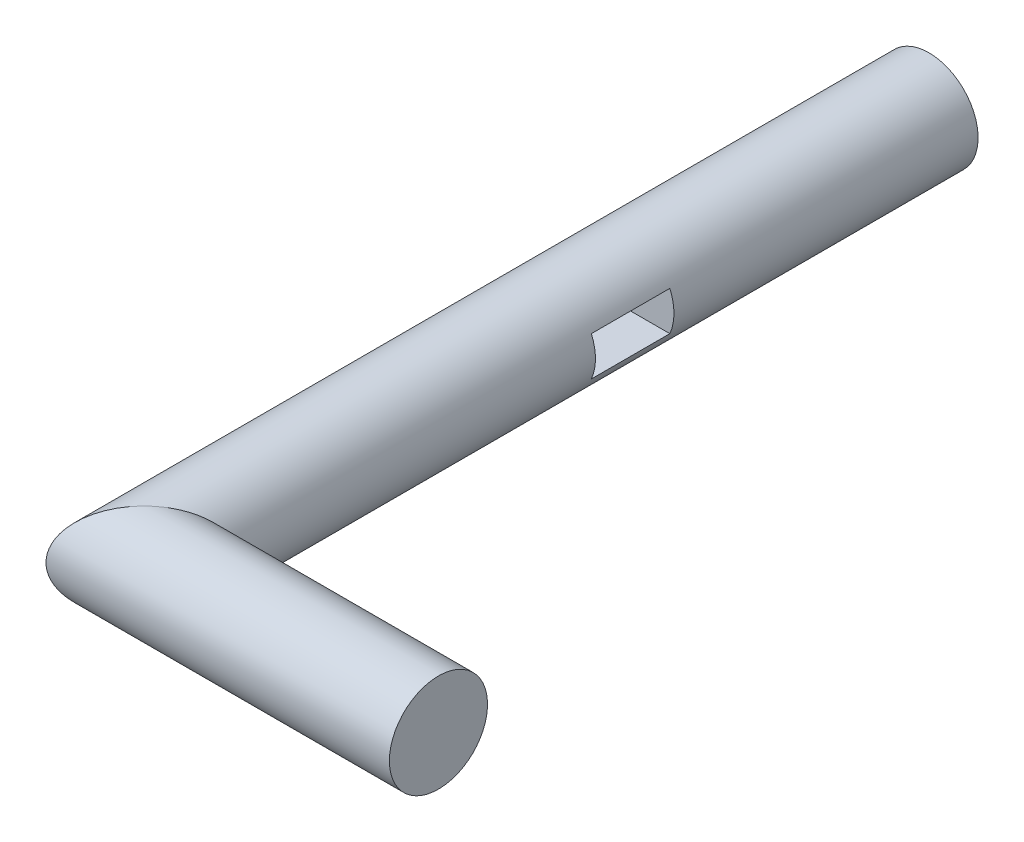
from build123d import *

# Parameters (mm, degrees)
SWEEP2_PROFILE_R        = 5
CUT_EXTRUDE1_DEPTH      = 77.321687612
CUT_EXTRUDE1_DEPTH_BACK = 77.321687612
SKETCH4_W               = 8
SKETCH4_H               = 4


with BuildPart() as part:
    # Sweep2: sweep along a path in Sketch2
    with BuildLine(Plane(origin=(0, 0, 0), x_dir=(1, 0, 0), z_dir=(0, 1, 0))) as sweep2_path:
        Line((0, 70), (0, -10))
        Line((0, -10), (30, -10))
    # Sweep2 profile (on start of the path) → Sweep2 (sweep)
    with BuildSketch(Plane.XY.offset(-70)):
        Circle(SWEEP2_PROFILE_R)
    sweep(path=sweep2_path.line, transition=Transition.RIGHT)

    # Sketch4 → Cut-Extrude1 (cut, two sides: drawn at the far end of the back side and taken through both)
    with BuildSketch(Plane(origin=(0, 0, 0), x_dir=(0, 0, -1), z_dir=(1, 0, 0)).offset(-CUT_EXTRUDE1_DEPTH_BACK)):
        with Locations((35, 0)):
            Rectangle(SKETCH4_W, SKETCH4_H)
    extrude(amount=CUT_EXTRUDE1_DEPTH + CUT_EXTRUDE1_DEPTH_BACK, mode=Mode.SUBTRACT)


solid = part.part
